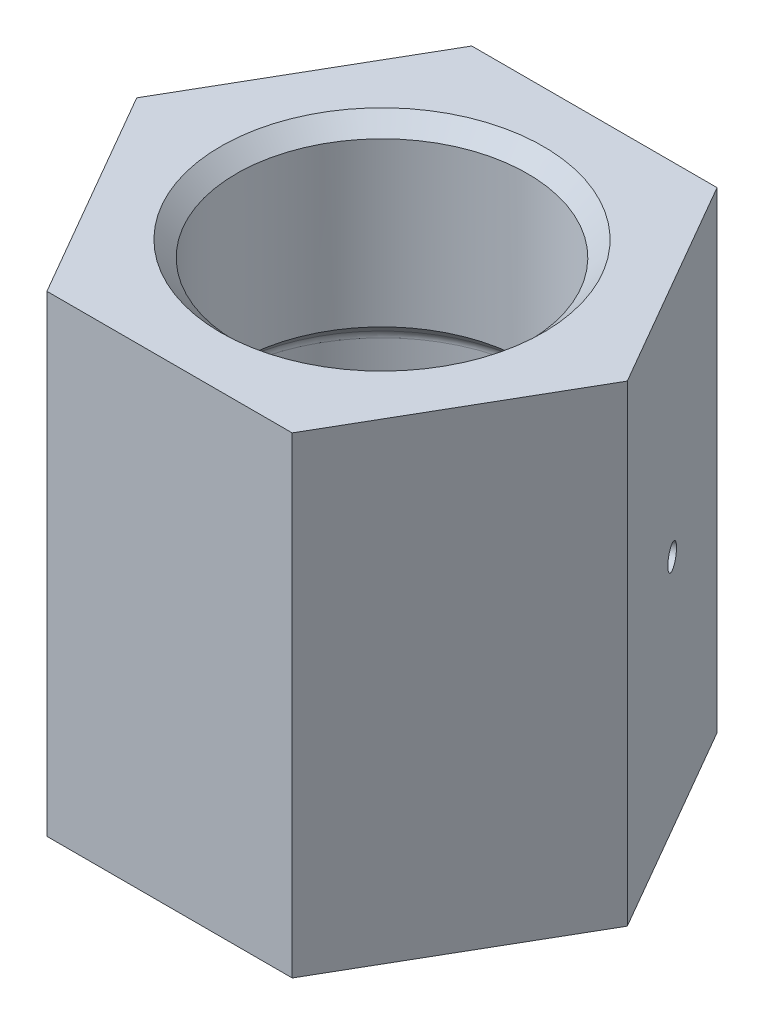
ISO-10303-21;
HEADER;
FILE_DESCRIPTION(('STEP AP214'),'2;1');
FILE_NAME('part.step','',(''),(''),'','','');
FILE_SCHEMA(('AUTOMOTIVE_DESIGN { 1 0 10303 214 1 1 1 1 }'));
ENDSEC;
DATA;
#1=APPLICATION_CONTEXT('core data for automotive mechanical design processes');
#2=APPLICATION_PROTOCOL_DEFINITION('international standard','automotive_design',2000,#1);
#3=PRODUCT_CONTEXT('',#1,'mechanical');
#4=PRODUCT('Part','Part','',(#3));
#5=PRODUCT_RELATED_PRODUCT_CATEGORY('part','',(#4));
#6=PRODUCT_DEFINITION_FORMATION('','',#4);
#7=PRODUCT_DEFINITION_CONTEXT('part definition',#1,'design');
#8=PRODUCT_DEFINITION('design','',#6,#7);
#9=PRODUCT_DEFINITION_SHAPE('','',#8);
#10=(LENGTH_UNIT() NAMED_UNIT(*) SI_UNIT(.MILLI.,.METRE.));
#11=(NAMED_UNIT(*) PLANE_ANGLE_UNIT() SI_UNIT($,.RADIAN.));
#12=(NAMED_UNIT(*) SI_UNIT($,.STERADIAN.) SOLID_ANGLE_UNIT());
#13=UNCERTAINTY_MEASURE_WITH_UNIT(LENGTH_MEASURE(1.E-05),#10,'distance_accuracy_value','');
#14=(GEOMETRIC_REPRESENTATION_CONTEXT(3) GLOBAL_UNCERTAINTY_ASSIGNED_CONTEXT((#13)) GLOBAL_UNIT_ASSIGNED_CONTEXT((#10,
#11,#12)) REPRESENTATION_CONTEXT('',''));
#15=CARTESIAN_POINT('',(0.,0.,0.));
#16=DIRECTION('',(0.,0.,1.));
#17=DIRECTION('',(1.,0.,0.));
#18=AXIS2_PLACEMENT_3D('',#15,#16,#17);
#19=CARTESIAN_POINT('',(0.,30.,0.));
#20=DIRECTION('',(0.,1.,0.));
#21=DIRECTION('',(0.,0.,1.));
#22=AXIS2_PLACEMENT_3D('',#19,#20,#21);
#23=CYLINDRICAL_SURFACE('',#22,9.25);
#24=CARTESIAN_POINT('',(0.,1.00000000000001,0.));
#25=DIRECTION('',(0.,1.,0.));
#26=DIRECTION('',(0.,0.,1.));
#27=AXIS2_PLACEMENT_3D('',#24,#25,#26);
#28=CIRCLE('',#27,9.25);
#29=CARTESIAN_POINT('',(0.,1.00000000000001,9.24999999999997));
#30=VERTEX_POINT('',#29);
#31=EDGE_CURVE('E149',#30,#30,#28,.F.);
#32=ORIENTED_EDGE('',*,*,#31,.T.);
#33=EDGE_LOOP('',(#32));
#34=FACE_BOUND('',#33,.T.);
#35=CARTESIAN_POINT('',(0.,12.6496213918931,0.));
#36=DIRECTION('',(0.,-1.,0.));
#37=DIRECTION('',(0.,0.,-1.));
#38=AXIS2_PLACEMENT_3D('',#35,#36,#37);
#39=CIRCLE('',#38,9.25);
#40=CARTESIAN_POINT('',(0.,12.6496213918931,-9.25));
#41=VERTEX_POINT('',#40);
#42=EDGE_CURVE('E127',#41,#41,#39,.T.);
#43=ORIENTED_EDGE('',*,*,#42,.F.);
#44=EDGE_LOOP('',(#43));
#45=FACE_BOUND('',#44,.T.);
#46=ADVANCED_FACE('F37',(#34,#45),#23,.F.);
#47=CARTESIAN_POINT('',(0.,29.,0.));
#48=DIRECTION('',(0.,1.,0.));
#49=DIRECTION('',(0.,0.,1.));
#50=AXIS2_PLACEMENT_3D('',#47,#48,#49);
#51=CIRCLE('',#50,9.25);
#52=CARTESIAN_POINT('',(0.,29.,9.24999999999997));
#53=VERTEX_POINT('',#52);
#54=EDGE_CURVE('E146',#53,#53,#51,.T.);
#55=ORIENTED_EDGE('',*,*,#54,.T.);
#56=EDGE_LOOP('',(#55));
#57=FACE_BOUND('',#56,.T.);
#58=CARTESIAN_POINT('',(0.,18.6496213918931,0.));
#59=DIRECTION('',(0.,-1.,0.));
#60=DIRECTION('',(0.,0.,-1.));
#61=AXIS2_PLACEMENT_3D('',#58,#59,#60);
#62=CIRCLE('',#61,9.25000000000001);
#63=CARTESIAN_POINT('',(0.,18.6496213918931,-9.25000000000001));
#64=VERTEX_POINT('',#63);
#65=EDGE_CURVE('E189',#64,#64,#62,.T.);
#66=ORIENTED_EDGE('',*,*,#65,.T.);
#67=EDGE_LOOP('',(#66));
#68=FACE_BOUND('',#67,.T.);
#69=ADVANCED_FACE('F228',(#57,#68),#23,.F.);
#70=CARTESIAN_POINT('',(7.79422863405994,30.,13.5));
#71=DIRECTION('',(-0.866025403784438,0.,-0.5));
#72=DIRECTION('',(-0.5,0.,0.866025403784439));
#73=AXIS2_PLACEMENT_3D('',#70,#71,#72);
#74=PLANE('',#73);
#75=DIRECTION('',(0.5,0.,-0.866025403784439));
#76=VECTOR('',#75,1.);
#77=CARTESIAN_POINT('',(7.79422863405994,0.,13.5));
#78=LINE('',#77,#76);
#79=CARTESIAN_POINT('',(7.79422863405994,0.,13.5));
#80=VERTEX_POINT('',#79);
#81=CARTESIAN_POINT('',(15.5884572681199,0.,0.));
#82=VERTEX_POINT('',#81);
#83=EDGE_CURVE('E123',#80,#82,#78,.T.);
#84=ORIENTED_EDGE('',*,*,#83,.T.);
#85=DIRECTION('',(0.,-1.,0.));
#86=VECTOR('',#85,1.);
#87=CARTESIAN_POINT('',(15.5884572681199,30.,0.));
#88=LINE('',#87,#86);
#89=CARTESIAN_POINT('',(15.5884572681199,30.,0.));
#90=VERTEX_POINT('',#89);
#91=EDGE_CURVE('E141',#90,#82,#88,.T.);
#92=ORIENTED_EDGE('',*,*,#91,.F.);
#93=DIRECTION('',(0.5,0.,-0.866025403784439));
#94=VECTOR('',#93,1.);
#95=CARTESIAN_POINT('',(7.79422863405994,30.,13.5));
#96=LINE('',#95,#94);
#97=CARTESIAN_POINT('',(7.79422863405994,30.,13.5));
#98=VERTEX_POINT('',#97);
#99=EDGE_CURVE('E134',#98,#90,#96,.T.);
#100=ORIENTED_EDGE('',*,*,#99,.F.);
#101=DIRECTION('',(0.,-1.,0.));
#102=VECTOR('',#101,1.);
#103=CARTESIAN_POINT('',(7.79422863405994,30.,13.5));
#104=LINE('',#103,#102);
#105=EDGE_CURVE('E119',#98,#80,#104,.T.);
#106=ORIENTED_EDGE('',*,*,#105,.T.);
#107=EDGE_LOOP('',(#84,#92,#100,#106));
#108=FACE_BOUND('',#107,.T.);
#109=ADVANCED_FACE('F215',(#108),#74,.F.);
#110=CARTESIAN_POINT('',(15.5884572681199,30.,0.));
#111=DIRECTION('',(-0.866025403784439,0.,0.5));
#112=DIRECTION('',(0.5,0.,0.866025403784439));
#113=AXIS2_PLACEMENT_3D('',#110,#111,#112);
#114=PLANE('',#113);
#115=CARTESIAN_POINT('',(11.6913429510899,15.,-6.75));
#116=DIRECTION('',(0.866025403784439,0.,-0.5));
#117=DIRECTION('',(-0.5,0.,-0.866025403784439));
#118=AXIS2_PLACEMENT_3D('',#115,#116,#117);
#119=CIRCLE('',#118,0.75);
#120=CARTESIAN_POINT('',(11.3163429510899,15.,-7.39951905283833));
#121=VERTEX_POINT('',#120);
#122=EDGE_CURVE('E196',#121,#121,#119,.T.);
#123=ORIENTED_EDGE('',*,*,#122,.F.);
#124=EDGE_LOOP('',(#123));
#125=FACE_BOUND('',#124,.T.);
#126=DIRECTION('',(-0.5,0.,-0.866025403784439));
#127=VECTOR('',#126,1.);
#128=CARTESIAN_POINT('',(15.5884572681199,0.,0.));
#129=LINE('',#128,#127);
#130=CARTESIAN_POINT('',(7.79422863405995,0.,-13.5));
#131=VERTEX_POINT('',#130);
#132=EDGE_CURVE('E126',#82,#131,#129,.T.);
#133=ORIENTED_EDGE('',*,*,#132,.T.);
#134=DIRECTION('',(0.,-1.,0.));
#135=VECTOR('',#134,1.);
#136=CARTESIAN_POINT('',(7.79422863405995,30.,-13.5));
#137=LINE('',#136,#135);
#138=CARTESIAN_POINT('',(7.79422863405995,30.,-13.5));
#139=VERTEX_POINT('',#138);
#140=EDGE_CURVE('E138',#139,#131,#137,.T.);
#141=ORIENTED_EDGE('',*,*,#140,.F.);
#142=DIRECTION('',(-0.5,0.,-0.866025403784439));
#143=VECTOR('',#142,1.);
#144=CARTESIAN_POINT('',(15.5884572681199,30.,0.));
#145=LINE('',#144,#143);
#146=EDGE_CURVE('E92',#90,#139,#145,.T.);
#147=ORIENTED_EDGE('',*,*,#146,.F.);
#148=ORIENTED_EDGE('',*,*,#91,.T.);
#149=EDGE_LOOP('',(#133,#141,#147,#148));
#150=FACE_BOUND('',#149,.T.);
#151=ADVANCED_FACE('F207',(#125,#150),#114,.F.);
#152=CARTESIAN_POINT('',(7.79422863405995,30.,-13.5));
#153=DIRECTION('',(0.,0.,1.));
#154=DIRECTION('',(1.,0.,0.));
#155=AXIS2_PLACEMENT_3D('',#152,#153,#154);
#156=PLANE('',#155);
#157=DIRECTION('',(-1.,0.,0.));
#158=VECTOR('',#157,1.);
#159=CARTESIAN_POINT('',(7.79422863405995,0.,-13.5));
#160=LINE('',#159,#158);
#161=CARTESIAN_POINT('',(-7.79422863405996,0.,-13.5));
#162=VERTEX_POINT('',#161);
#163=EDGE_CURVE('E129',#131,#162,#160,.T.);
#164=ORIENTED_EDGE('',*,*,#163,.T.);
#165=DIRECTION('',(0.,-1.,0.));
#166=VECTOR('',#165,1.);
#167=CARTESIAN_POINT('',(-7.79422863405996,30.,-13.5));
#168=LINE('',#167,#166);
#169=CARTESIAN_POINT('',(-7.79422863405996,30.,-13.5));
#170=VERTEX_POINT('',#169);
#171=EDGE_CURVE('E114',#170,#162,#168,.T.);
#172=ORIENTED_EDGE('',*,*,#171,.F.);
#173=DIRECTION('',(-1.,0.,0.));
#174=VECTOR('',#173,1.);
#175=CARTESIAN_POINT('',(7.79422863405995,30.,-13.5));
#176=LINE('',#175,#174);
#177=EDGE_CURVE('E105',#139,#170,#176,.T.);
#178=ORIENTED_EDGE('',*,*,#177,.F.);
#179=ORIENTED_EDGE('',*,*,#140,.T.);
#180=EDGE_LOOP('',(#164,#172,#178,#179));
#181=FACE_BOUND('',#180,.T.);
#182=ADVANCED_FACE('F210',(#181),#156,.F.);
#183=CARTESIAN_POINT('',(-7.79422863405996,30.,-13.5));
#184=DIRECTION('',(0.866025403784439,0.,0.499999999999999));
#185=DIRECTION('',(0.499999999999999,0.,-0.866025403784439));
#186=AXIS2_PLACEMENT_3D('',#183,#184,#185);
#187=PLANE('',#186);
#188=DIRECTION('',(-0.499999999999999,0.,0.866025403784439));
#189=VECTOR('',#188,1.);
#190=CARTESIAN_POINT('',(-7.79422863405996,0.,-13.5));
#191=LINE('',#190,#189);
#192=CARTESIAN_POINT('',(-15.5884572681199,0.,0.));
#193=VERTEX_POINT('',#192);
#194=EDGE_CURVE('E113',#162,#193,#191,.T.);
#195=ORIENTED_EDGE('',*,*,#194,.T.);
#196=DIRECTION('',(0.,-1.,0.));
#197=VECTOR('',#196,1.);
#198=CARTESIAN_POINT('',(-15.5884572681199,30.,0.));
#199=LINE('',#198,#197);
#200=CARTESIAN_POINT('',(-15.5884572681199,30.,0.));
#201=VERTEX_POINT('',#200);
#202=EDGE_CURVE('E110',#201,#193,#199,.T.);
#203=ORIENTED_EDGE('',*,*,#202,.F.);
#204=DIRECTION('',(-0.499999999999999,0.,0.866025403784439));
#205=VECTOR('',#204,1.);
#206=CARTESIAN_POINT('',(-7.79422863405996,30.,-13.5));
#207=LINE('',#206,#205);
#208=EDGE_CURVE('E99',#170,#201,#207,.T.);
#209=ORIENTED_EDGE('',*,*,#208,.F.);
#210=ORIENTED_EDGE('',*,*,#171,.T.);
#211=EDGE_LOOP('',(#195,#203,#209,#210));
#212=FACE_BOUND('',#211,.T.);
#213=ADVANCED_FACE('F111',(#212),#187,.F.);
#214=CARTESIAN_POINT('',(-15.5884572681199,30.,0.));
#215=DIRECTION('',(0.866025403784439,0.,-0.5));
#216=DIRECTION('',(-0.5,0.,-0.866025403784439));
#217=AXIS2_PLACEMENT_3D('',#214,#215,#216);
#218=PLANE('',#217);
#219=DIRECTION('',(0.5,0.,0.866025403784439));
#220=VECTOR('',#219,1.);
#221=CARTESIAN_POINT('',(-15.5884572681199,0.,0.));
#222=LINE('',#221,#220);
#223=CARTESIAN_POINT('',(-7.79422863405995,0.,13.5));
#224=VERTEX_POINT('',#223);
#225=EDGE_CURVE('E77',#193,#224,#222,.T.);
#226=ORIENTED_EDGE('',*,*,#225,.T.);
#227=DIRECTION('',(0.,-1.,0.));
#228=VECTOR('',#227,1.);
#229=CARTESIAN_POINT('',(-7.79422863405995,30.,13.5));
#230=LINE('',#229,#228);
#231=CARTESIAN_POINT('',(-7.79422863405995,30.,13.5));
#232=VERTEX_POINT('',#231);
#233=EDGE_CURVE('E115',#232,#224,#230,.T.);
#234=ORIENTED_EDGE('',*,*,#233,.F.);
#235=DIRECTION('',(0.5,0.,0.866025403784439));
#236=VECTOR('',#235,1.);
#237=CARTESIAN_POINT('',(-15.5884572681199,30.,0.));
#238=LINE('',#237,#236);
#239=EDGE_CURVE('E103',#201,#232,#238,.T.);
#240=ORIENTED_EDGE('',*,*,#239,.F.);
#241=ORIENTED_EDGE('',*,*,#202,.T.);
#242=EDGE_LOOP('',(#226,#234,#240,#241));
#243=FACE_BOUND('',#242,.T.);
#244=ADVANCED_FACE('F117',(#243),#218,.F.);
#245=CARTESIAN_POINT('',(-7.79422863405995,30.,13.5));
#246=DIRECTION('',(0.,0.,-1.));
#247=DIRECTION('',(-1.,0.,0.));
#248=AXIS2_PLACEMENT_3D('',#245,#246,#247);
#249=PLANE('',#248);
#250=DIRECTION('',(1.,0.,0.));
#251=VECTOR('',#250,1.);
#252=CARTESIAN_POINT('',(-7.79422863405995,0.,13.5));
#253=LINE('',#252,#251);
#254=EDGE_CURVE('E83',#224,#80,#253,.T.);
#255=ORIENTED_EDGE('',*,*,#254,.T.);
#256=ORIENTED_EDGE('',*,*,#105,.F.);
#257=DIRECTION('',(1.,0.,0.));
#258=VECTOR('',#257,1.);
#259=CARTESIAN_POINT('',(-7.79422863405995,30.,13.5));
#260=LINE('',#259,#258);
#261=EDGE_CURVE('E54',#232,#98,#260,.T.);
#262=ORIENTED_EDGE('',*,*,#261,.F.);
#263=ORIENTED_EDGE('',*,*,#233,.T.);
#264=EDGE_LOOP('',(#255,#256,#262,#263));
#265=FACE_BOUND('',#264,.T.);
#266=ADVANCED_FACE('F216',(#265),#249,.F.);
#267=CARTESIAN_POINT('',(15.5884572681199,30.,0.));
#268=DIRECTION('',(0.,1.,0.));
#269=DIRECTION('',(0.,0.,1.));
#270=AXIS2_PLACEMENT_3D('',#267,#268,#269);
#271=PLANE('',#270);
#272=CARTESIAN_POINT('',(0.,30.,0.));
#273=DIRECTION('',(0.,1.,0.));
#274=DIRECTION('',(0.,0.,1.));
#275=AXIS2_PLACEMENT_3D('',#272,#273,#274);
#276=CIRCLE('',#275,10.25);
#277=CARTESIAN_POINT('',(0.,30.,10.25));
#278=VERTEX_POINT('',#277);
#279=EDGE_CURVE('E152',#278,#278,#276,.F.);
#280=ORIENTED_EDGE('',*,*,#279,.T.);
#281=EDGE_LOOP('',(#280));
#282=FACE_BOUND('',#281,.T.);
#283=ORIENTED_EDGE('',*,*,#99,.T.);
#284=ORIENTED_EDGE('',*,*,#146,.T.);
#285=ORIENTED_EDGE('',*,*,#177,.T.);
#286=ORIENTED_EDGE('',*,*,#208,.T.);
#287=ORIENTED_EDGE('',*,*,#239,.T.);
#288=ORIENTED_EDGE('',*,*,#261,.T.);
#289=EDGE_LOOP('',(#283,#284,#285,#286,#287,#288));
#290=FACE_BOUND('',#289,.T.);
#291=ADVANCED_FACE('F101',(#282,#290),#271,.T.);
#292=CARTESIAN_POINT('',(15.5884572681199,0.,0.));
#293=DIRECTION('',(0.,1.,0.));
#294=DIRECTION('',(0.,0.,1.));
#295=AXIS2_PLACEMENT_3D('',#292,#293,#294);
#296=PLANE('',#295);
#297=CARTESIAN_POINT('',(0.,0.,0.));
#298=DIRECTION('',(0.,1.,0.));
#299=DIRECTION('',(0.,0.,1.));
#300=AXIS2_PLACEMENT_3D('',#297,#298,#299);
#301=CIRCLE('',#300,10.25);
#302=CARTESIAN_POINT('',(0.,0.,10.25));
#303=VERTEX_POINT('',#302);
#304=EDGE_CURVE('E143',#303,#303,#301,.T.);
#305=ORIENTED_EDGE('',*,*,#304,.T.);
#306=EDGE_LOOP('',(#305));
#307=FACE_BOUND('',#306,.T.);
#308=ORIENTED_EDGE('',*,*,#83,.F.);
#309=ORIENTED_EDGE('',*,*,#254,.F.);
#310=ORIENTED_EDGE('',*,*,#225,.F.);
#311=ORIENTED_EDGE('',*,*,#194,.F.);
#312=ORIENTED_EDGE('',*,*,#163,.F.);
#313=ORIENTED_EDGE('',*,*,#132,.F.);
#314=EDGE_LOOP('',(#308,#309,#310,#311,#312,#313));
#315=FACE_BOUND('',#314,.T.);
#316=ADVANCED_FACE('F213',(#307,#315),#296,.F.);
#317=CARTESIAN_POINT('',(0.,0.,0.));
#318=DIRECTION('',(0.,-1.,0.));
#319=DIRECTION('',(0.,0.,-1.));
#320=AXIS2_PLACEMENT_3D('',#317,#318,#319);
#321=CONICAL_SURFACE('',#320,10.25,0.785398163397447);
#322=ORIENTED_EDGE('',*,*,#31,.F.);
#323=EDGE_LOOP('',(#322));
#324=FACE_BOUND('',#323,.T.);
#325=ORIENTED_EDGE('',*,*,#304,.F.);
#326=EDGE_LOOP('',(#325));
#327=FACE_BOUND('',#326,.T.);
#328=ADVANCED_FACE('F238',(#324,#327),#321,.F.);
#329=CARTESIAN_POINT('',(0.,29.,0.));
#330=DIRECTION('',(0.,1.,0.));
#331=DIRECTION('',(0.,0.,1.));
#332=AXIS2_PLACEMENT_3D('',#329,#330,#331);
#333=CONICAL_SURFACE('',#332,9.25,0.785398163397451);
#334=ORIENTED_EDGE('',*,*,#279,.F.);
#335=EDGE_LOOP('',(#334));
#336=FACE_BOUND('',#335,.T.);
#337=ORIENTED_EDGE('',*,*,#54,.F.);
#338=EDGE_LOOP('',(#337));
#339=FACE_BOUND('',#338,.T.);
#340=ADVANCED_FACE('F243',(#336,#339),#333,.F.);
#341=CARTESIAN_POINT('',(0.,13.6496213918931,0.));
#342=DIRECTION('',(0.,1.,0.));
#343=DIRECTION('',(0.,0.,1.));
#344=AXIS2_PLACEMENT_3D('',#341,#342,#343);
#345=CONICAL_SURFACE('',#344,10.25,0.785398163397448);
#346=CARTESIAN_POINT('',(0.,13.429951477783,0.));
#347=DIRECTION('',(0.,1.,0.));
#348=DIRECTION('',(0.,0.,1.));
#349=AXIS2_PLACEMENT_3D('',#346,#347,#348);
#350=CIRCLE('',#349,10.0303300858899);
#351=CARTESIAN_POINT('',(0.,13.429951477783,10.0303300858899));
#352=VERTEX_POINT('',#351);
#353=EDGE_CURVE('E46',#352,#352,#350,.T.);
#354=ORIENTED_EDGE('',*,*,#353,.T.);
#355=EDGE_LOOP('',(#354));
#356=FACE_BOUND('',#355,.T.);
#357=ORIENTED_EDGE('',*,*,#42,.T.);
#358=EDGE_LOOP('',(#357));
#359=FACE_BOUND('',#358,.T.);
#360=ADVANCED_FACE('F163',(#356,#359),#345,.F.);
#361=CARTESIAN_POINT('',(0.,0.,0.));
#362=DIRECTION('',(0.,-1.,0.));
#363=DIRECTION('',(0.,0.,-1.));
#364=AXIS2_PLACEMENT_3D('',#361,#362,#363);
#365=CYLINDRICAL_SURFACE('',#364,10.25);
#366=CARTESIAN_POINT('',(8.47796560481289,15.,-5.76078112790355));
#367=CARTESIAN_POINT('',(8.47796684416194,15.0420672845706,-5.76077971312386));
#368=CARTESIAN_POINT('',(8.47996851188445,15.0841636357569,-5.75783691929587));
#369=CARTESIAN_POINT('',(8.48790574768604,15.1671928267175,-5.74612948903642));
#370=CARTESIAN_POINT('',(8.49384583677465,15.2081242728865,-5.73735816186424));
#371=CARTESIAN_POINT('',(8.50943204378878,15.287609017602,-5.71421558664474));
#372=CARTESIAN_POINT('',(8.51907613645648,15.3261636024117,-5.6998473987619));
#373=CARTESIAN_POINT('',(8.54170798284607,15.3998178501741,-5.66587498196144));
#374=CARTESIAN_POINT('',(8.554694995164,15.4349182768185,-5.64627191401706));
#375=CARTESIAN_POINT('',(8.58356697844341,15.5007480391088,-5.60228250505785));
#376=CARTESIAN_POINT('',(8.59945706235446,15.5314694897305,-5.57788771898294));
#377=CARTESIAN_POINT('',(8.63355799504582,15.5876016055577,-5.52495840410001));
#378=CARTESIAN_POINT('',(8.65176894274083,15.6130120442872,-5.49642369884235));
#379=CARTESIAN_POINT('',(8.68990946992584,15.6578261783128,-5.43592233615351));
#380=CARTESIAN_POINT('',(8.70984093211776,15.6772231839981,-5.40395190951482));
#381=CARTESIAN_POINT('',(8.75074696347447,15.7094170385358,-5.33745723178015));
#382=CARTESIAN_POINT('',(8.77172151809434,15.7222139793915,-5.30293301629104));
#383=CARTESIAN_POINT('',(8.81401254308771,15.7408221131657,-5.23233905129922));
#384=CARTESIAN_POINT('',(8.83532832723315,15.7466458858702,-5.19627220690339));
#385=CARTESIAN_POINT('',(8.87770045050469,15.7511812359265,-5.12354424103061));
#386=CARTESIAN_POINT('',(8.89875679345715,15.7498929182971,-5.08688312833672));
#387=CARTESIAN_POINT('',(8.93997726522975,15.7402509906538,-5.01408549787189));
#388=CARTESIAN_POINT('',(8.96014302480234,15.7319109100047,-4.97794811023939));
#389=CARTESIAN_POINT('',(8.99909803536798,15.7084232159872,-4.90717508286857));
#390=CARTESIAN_POINT('',(9.01788727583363,15.6932755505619,-4.8725394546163));
#391=CARTESIAN_POINT('',(9.0536522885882,15.6565874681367,-4.80575883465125));
#392=CARTESIAN_POINT('',(9.07062631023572,15.6350409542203,-4.77361625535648));
#393=CARTESIAN_POINT('',(9.10236272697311,15.5861712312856,-4.71281982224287));
#394=CARTESIAN_POINT('',(9.11712508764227,15.5588479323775,-4.6841660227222));
#395=CARTESIAN_POINT('',(9.1441672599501,15.4991239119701,-4.63115478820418));
#396=CARTESIAN_POINT('',(9.15644117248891,15.4667114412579,-4.60680757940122));
#397=CARTESIAN_POINT('',(9.17822840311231,15.3977702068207,-4.56324648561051));
#398=CARTESIAN_POINT('',(9.18774171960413,15.3612414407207,-4.54403260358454));
#399=CARTESIAN_POINT('',(9.20383761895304,15.2850966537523,-4.51134201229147));
#400=CARTESIAN_POINT('',(9.21041995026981,15.2454803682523,-4.49786579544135));
#401=CARTESIAN_POINT('',(9.22053946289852,15.1642887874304,-4.47708462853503));
#402=CARTESIAN_POINT('',(9.22407669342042,15.1227135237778,-4.4697795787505));
#403=CARTESIAN_POINT('',(9.22804243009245,15.0388872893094,-4.46158648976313));
#404=CARTESIAN_POINT('',(9.22847812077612,14.9966381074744,-4.4606836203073));
#405=CARTESIAN_POINT('',(9.22625262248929,14.9125727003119,-4.46528485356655));
#406=CARTESIAN_POINT('',(9.22359145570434,14.870756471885,-4.47078891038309));
#407=CARTESIAN_POINT('',(9.21522101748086,14.7887907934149,-4.48801651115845));
#408=CARTESIAN_POINT('',(9.20951510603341,14.7486395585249,-4.49973319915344));
#409=CARTESIAN_POINT('',(9.19515370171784,14.6710884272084,-4.52900791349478));
#410=CARTESIAN_POINT('',(9.18649817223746,14.6336885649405,-4.54656601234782));
#411=CARTESIAN_POINT('',(9.16637116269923,14.5626264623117,-4.58700870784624));
#412=CARTESIAN_POINT('',(9.15489454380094,14.5289712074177,-4.60990302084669));
#413=CARTESIAN_POINT('',(9.12934778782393,14.4664241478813,-4.66029020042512));
#414=CARTESIAN_POINT('',(9.11527761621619,14.4375324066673,-4.68778312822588));
#415=CARTESIAN_POINT('',(9.08479679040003,14.3852767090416,-4.74658444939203));
#416=CARTESIAN_POINT('',(9.06838172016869,14.3619234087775,-4.77790002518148));
#417=CARTESIAN_POINT('',(9.0335899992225,14.3214805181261,-4.84335872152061));
#418=CARTESIAN_POINT('',(9.01521336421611,14.3043908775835,-4.87750181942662));
#419=CARTESIAN_POINT('',(8.97695411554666,14.2769788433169,-4.94756354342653));
#420=CARTESIAN_POINT('',(8.9570730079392,14.2666497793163,-4.98348038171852));
#421=CARTESIAN_POINT('',(8.91630062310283,14.2530302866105,-5.05606717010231));
#422=CARTESIAN_POINT('',(8.89540936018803,14.2497397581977,-5.09273710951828));
#423=CARTESIAN_POINT('',(8.85324462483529,14.250291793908,-5.16568780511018));
#424=CARTESIAN_POINT('',(8.8319721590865,14.2541177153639,-5.20196927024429));
#425=CARTESIAN_POINT('',(8.78962228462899,14.2687594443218,-5.27321136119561));
#426=CARTESIAN_POINT('',(8.76854487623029,14.2795752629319,-5.30817198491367));
#427=CARTESIAN_POINT('',(8.7272387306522,14.3078857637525,-5.37581397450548));
#428=CARTESIAN_POINT('',(8.70700996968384,14.3253802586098,-5.40849540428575));
#429=CARTESIAN_POINT('',(8.66805631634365,14.3665494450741,-5.47070822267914));
#430=CARTESIAN_POINT('',(8.64933139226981,14.3902240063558,-5.5002396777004));
#431=CARTESIAN_POINT('',(8.61397649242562,14.4431434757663,-5.55544668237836));
#432=CARTESIAN_POINT('',(8.59735124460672,14.4724005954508,-5.58111355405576));
#433=CARTESIAN_POINT('',(8.56682336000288,14.5356347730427,-5.6278609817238));
#434=CARTESIAN_POINT('',(8.55292138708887,14.5696129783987,-5.64894041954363));
#435=CARTESIAN_POINT('',(8.52832971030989,14.6413764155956,-5.6859994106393));
#436=CARTESIAN_POINT('',(8.5176449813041,14.6791674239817,-5.70197106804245));
#437=CARTESIAN_POINT('',(8.49992525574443,14.7574150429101,-5.72835277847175));
#438=CARTESIAN_POINT('',(8.49288602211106,14.7978684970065,-5.73876928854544));
#439=CARTESIAN_POINT('',(8.48453623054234,14.8654711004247,-5.75110220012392));
#440=CARTESIAN_POINT('',(8.4820763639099,14.8921842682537,-5.75472755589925));
#441=CARTESIAN_POINT('',(8.47879065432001,14.9459276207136,-5.75956747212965));
#442=CARTESIAN_POINT('',(8.47796480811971,14.9729578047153,-5.76078203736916));
#443=CARTESIAN_POINT('',(8.47796560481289,15.,-5.76078112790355));
#444=B_SPLINE_CURVE_WITH_KNOTS('',3,(#366,#367,#368,#369,#370,#371,#372,#373,#374,#375,#376,
#377,#378,#379,#380,#381,#382,#383,#384,#385,#386,#387,#388,#389,#390,#391,#392,#393,#394,#395,
#396,#397,#398,#399,#400,#401,#402,#403,#404,#405,#406,#407,#408,#409,#410,#411,#412,#413,#414,
#415,#416,#417,#418,#419,#420,#421,#422,#423,#424,#425,#426,#427,#428,#429,#430,#431,#432,#433,
#434,#435,#436,#437,#438,#439,#440,#441,#442,#443),.UNSPECIFIED.,.T.,.F.,(4,2,2,2,2,2,2,2,2,2,2,
2,2,2,2,2,2,2,2,2,2,2,2,2,2,2,2,2,2,2,2,2,2,2,2,2,2,2,4),(0.,0.126103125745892,
0.252351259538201,0.378530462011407,0.504681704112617,0.631057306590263,0.75743829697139,
0.883959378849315,1.01047869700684,1.13676942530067,1.26305828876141,1.38910540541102,
1.51515348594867,1.6413220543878,1.76749258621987,1.89395880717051,2.02042510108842,
2.14690224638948,2.27337734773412,2.3995593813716,2.52574051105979,2.65178268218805,
2.77782641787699,2.90410147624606,3.03037821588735,3.15689598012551,3.28341273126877,
3.4098044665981,3.53619441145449,3.66228914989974,3.78838408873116,3.91447549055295,
4.04056423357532,4.16693201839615,4.29333057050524,4.41992358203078,4.54636912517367,
4.62743240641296,4.70849552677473),.UNSPECIFIED.);
#445=CARTESIAN_POINT('',(8.47796560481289,15.,-5.76078112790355));
#446=VERTEX_POINT('',#445);
#447=EDGE_CURVE('E191',#446,#446,#444,.T.);
#448=ORIENTED_EDGE('',*,*,#447,.T.);
#449=EDGE_LOOP('',(#448));
#450=FACE_BOUND('',#449,.T.);
#451=CARTESIAN_POINT('',(0.,13.9602815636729,0.));
#452=DIRECTION('',(0.,-1.,0.));
#453=DIRECTION('',(0.,0.,-1.));
#454=AXIS2_PLACEMENT_3D('',#451,#452,#453);
#455=CIRCLE('',#454,10.25);
#456=CARTESIAN_POINT('',(0.,13.9602815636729,-10.25));
#457=VERTEX_POINT('',#456);
#458=EDGE_CURVE('E158',#457,#457,#455,.T.);
#459=ORIENTED_EDGE('',*,*,#458,.T.);
#460=EDGE_LOOP('',(#459));
#461=FACE_BOUND('',#460,.T.);
#462=CARTESIAN_POINT('',(0.,17.3389612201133,0.));
#463=DIRECTION('',(0.,-1.,0.));
#464=DIRECTION('',(0.,0.,-1.));
#465=AXIS2_PLACEMENT_3D('',#462,#463,#464);
#466=CIRCLE('',#465,10.25);
#467=CARTESIAN_POINT('',(0.,17.3389612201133,-10.25));
#468=VERTEX_POINT('',#467);
#469=EDGE_CURVE('E155',#468,#468,#466,.F.);
#470=ORIENTED_EDGE('',*,*,#469,.T.);
#471=EDGE_LOOP('',(#470));
#472=FACE_BOUND('',#471,.T.);
#473=ADVANCED_FACE('F172',(#450,#461,#472),#365,.F.);
#474=CARTESIAN_POINT('',(0.,18.6496213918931,0.));
#475=DIRECTION('',(0.,-1.,0.));
#476=DIRECTION('',(0.,0.,-1.));
#477=AXIS2_PLACEMENT_3D('',#474,#475,#476);
#478=CONICAL_SURFACE('',#477,9.25000000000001,0.785398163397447);
#479=CARTESIAN_POINT('',(0.,17.8692913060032,0.));
#480=DIRECTION('',(0.,-1.,0.));
#481=DIRECTION('',(0.,0.,-1.));
#482=AXIS2_PLACEMENT_3D('',#479,#480,#481);
#483=CIRCLE('',#482,10.0303300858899);
#484=CARTESIAN_POINT('',(0.,17.8692913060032,-10.0303300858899));
#485=VERTEX_POINT('',#484);
#486=EDGE_CURVE('E11',#485,#485,#483,.T.);
#487=ORIENTED_EDGE('',*,*,#486,.T.);
#488=EDGE_LOOP('',(#487));
#489=FACE_BOUND('',#488,.T.);
#490=ORIENTED_EDGE('',*,*,#65,.F.);
#491=EDGE_LOOP('',(#490));
#492=FACE_BOUND('',#491,.T.);
#493=ADVANCED_FACE('F169',(#489,#492),#478,.F.);
#494=CARTESIAN_POINT('',(0.,13.9602815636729,0.));
#495=DIRECTION('',(0.,-1.,0.));
#496=DIRECTION('',(0.,0.,-1.));
#497=AXIS2_PLACEMENT_3D('',#494,#495,#496);
#498=TOROIDAL_SURFACE('',#497,9.5,0.75);
#499=ORIENTED_EDGE('',*,*,#353,.F.);
#500=EDGE_LOOP('',(#499));
#501=FACE_BOUND('',#500,.T.);
#502=ORIENTED_EDGE('',*,*,#458,.F.);
#503=EDGE_LOOP('',(#502));
#504=FACE_BOUND('',#503,.T.);
#505=ADVANCED_FACE('F166',(#501,#504),#498,.F.);
#506=CARTESIAN_POINT('',(0.,17.3389612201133,0.));
#507=DIRECTION('',(0.,-1.,0.));
#508=DIRECTION('',(0.,0.,-1.));
#509=AXIS2_PLACEMENT_3D('',#506,#507,#508);
#510=TOROIDAL_SURFACE('',#509,9.5,0.75);
#511=ORIENTED_EDGE('',*,*,#469,.F.);
#512=EDGE_LOOP('',(#511));
#513=FACE_BOUND('',#512,.T.);
#514=ORIENTED_EDGE('',*,*,#486,.F.);
#515=EDGE_LOOP('',(#514));
#516=FACE_BOUND('',#515,.T.);
#517=ADVANCED_FACE('F39',(#513,#516),#510,.F.);
#518=CARTESIAN_POINT('',(-17.5381974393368,15.,10.1256830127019));
#519=DIRECTION('',(0.866025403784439,0.,-0.5));
#520=DIRECTION('',(-0.5,0.,-0.866025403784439));
#521=AXIS2_PLACEMENT_3D('',#518,#519,#520);
#522=CYLINDRICAL_SURFACE('',#521,0.75);
#523=ORIENTED_EDGE('',*,*,#122,.T.);
#524=EDGE_LOOP('',(#523));
#525=FACE_BOUND('',#524,.T.);
#526=ORIENTED_EDGE('',*,*,#447,.F.);
#527=EDGE_LOOP('',(#526));
#528=FACE_BOUND('',#527,.T.);
#529=ADVANCED_FACE('F181',(#525,#528),#522,.F.);
#530=CLOSED_SHELL('',(#46,#69,#109,#151,#182,#213,#244,#266,#291,#316,#328,#340,#360,#473,#493,
#505,#517,#529));
#531=MANIFOLD_SOLID_BREP('B2',#530);
#532=ADVANCED_BREP_SHAPE_REPRESENTATION('',(#18,#531),#14);
#533=SHAPE_DEFINITION_REPRESENTATION(#9,#532);
ENDSEC;
END-ISO-10303-21;
